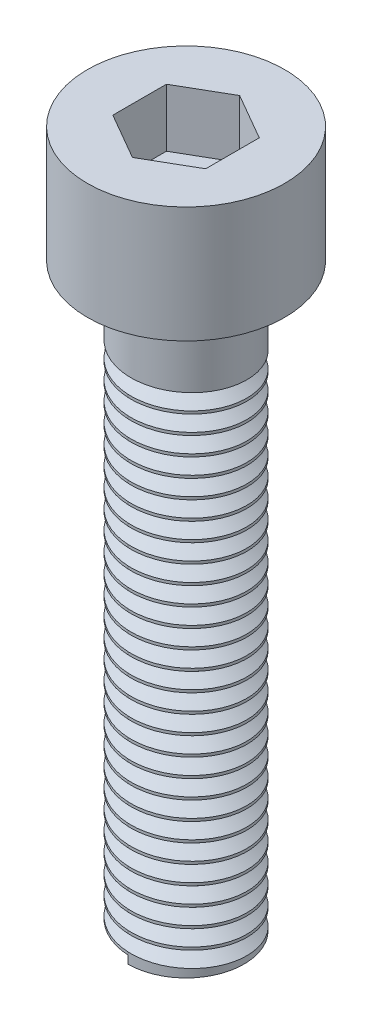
from build123d import *

# Parameters (mm, degrees)
SK_CABEZA_R         = 4.25
CABEZA_DEPTH        = 5
CANA_START          = -25
SK_CANA_R           = 2.5
CANA_DEPTH          = 25
HUECO_ALLEN_DEPTH   = 2.5
ROSCA_M5X0_8_PITCH  = 0.8
ROSCA_M5X0_8_HEIGHT = 22
ROSCA_M5X0_8_RADIUS = 2.5


with BuildPart() as part:
    # Sk_Cabeza → Cabeza (new body)
    with BuildSketch(Plane(origin=(0, 0, 0), x_dir=(1, 0, 0), z_dir=(0, 1, 0))):
        with Locations(Location((0, 0, 0), (0, 0, 270))):
            Circle(SK_CABEZA_R)
    extrude(amount=CABEZA_DEPTH)

    # Sk_Cana → Cana (add)
    with BuildSketch(Plane(origin=(0, 0, 0), x_dir=(1, 0, 0), z_dir=(0, 1, 0)).offset(CANA_START)):
        with Locations(Location((0, 0, 0), (0, 0, 270))):
            Circle(SK_CANA_R)
    extrude(amount=CANA_DEPTH)

    # Sk_Hueco_Allen → Hueco_Allen (cut)
    with BuildSketch(Plane(origin=(0, 5, 0), x_dir=(1, 0, 0), z_dir=(0, 1, 0))):
        Polygon((2, -1.154700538), (0, -2.309401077), (-2, -1.154700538), (-2, 1.154700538), (0, 2.309401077), (2, 1.154700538), align=None)
    extrude(amount=-HUECO_ALLEN_DEPTH, mode=Mode.SUBTRACT)

    # Rosca_M5x0_8: sweep along a helix
    with BuildLine() as rosca_m5x0_8_path:
        Helix(ROSCA_M5X0_8_PITCH, ROSCA_M5X0_8_HEIGHT, ROSCA_M5X0_8_RADIUS, center=(0, -25, 0), direction=(0, 1, 0), lefthand=True)
    # Sk_Perfil_rosca → Rosca_M5x0_8 (sweep, cut)
    with BuildSketch(Plane(origin=(0, 0, 0), x_dir=(0, 0, -1), z_dir=(1, 0, 0))):
        Polygon((-2.7, -25.48), (-2.00928, -25), (-2.7, -24.52), align=None)
    sweep(path=rosca_m5x0_8_path.line, is_frenet=True, mode=Mode.SUBTRACT)


solid = part.part
